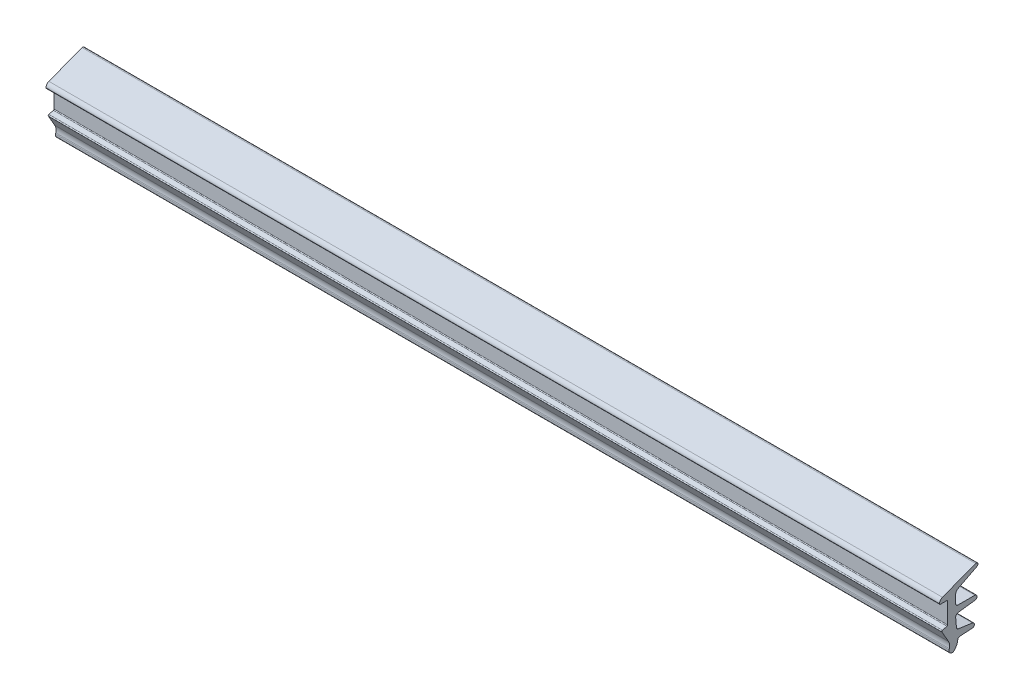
from build123d import *

# Parameters (mm, degrees)
PANEELITIIVISTEET_1_6020_PANEELITIIVISTE_DEPTH = 200


with BuildPart() as part:
    # Sketch1 → Paneelitiivisteet 1.6020 PANEELITIIVISTE (new body)
    with BuildSketch(Plane(origin=(0, 0, 0), x_dir=(0, 0, -1), z_dir=(1, 0, 0))):
        with BuildLine():
            Line((1.39116901, 4.409657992), (5.62675571, 6.567797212))
            ThreePointArc((5.62675571, 6.567797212), (5.810639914, 7.086754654), (5.302098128, 7.297741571))
            Line((5.302098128, 7.297741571), (-2.11249394, 4.458054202))
            ThreePointArc((-2.11249394, 4.458054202), (-2.578749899, 4.090921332), (-2.75484048, 3.524199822))
            ThreePointArc((-2.75484048, 3.524199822), (-2.696261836, 3.382778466), (-2.55484048, 3.324199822))
            Line((-2.55484048, 3.324199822), (-1.154840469, 3.324199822))
            ThreePointArc((-1.154840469, 3.324199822), (-1.013419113, 3.265621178), (-0.954840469, 3.124199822))
            Line((-0.954840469, 3.124199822), (-0.954840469, -1.475800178))
            ThreePointArc((-0.954840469, -1.475800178), (-0.996169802, -1.597552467), (-1.103076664, -1.668985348))
            Line((-1.103076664, -1.668985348), (-2.106604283, -1.937879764))
            ThreePointArc((-2.106604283, -1.937879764), (-2.23961638, -2.054528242), (-2.228045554, -2.231064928))
            Line((-2.228045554, -2.231064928), (-0.771162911, -4.754459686))
            ThreePointArc((-0.771162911, -4.754459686), (-0.520323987, -5.493407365), (-0.571362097, -6.272097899))
            Line((-0.571362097, -6.272097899), (-0.630988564, -6.494626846))
            ThreePointArc((-0.630988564, -6.494626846), (-0.285603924, -7.292724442), (0.570270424, -7.138680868))
            ThreePointArc((0.570270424, -7.138680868), (1.080637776, -6.373455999), (1.327562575, -5.487413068))
            ThreePointArc((1.327562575, -5.487413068), (1.480187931, -5.181371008), (1.793816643, -5.045013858))
            Line((1.793816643, -5.045013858), (4.575683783, -4.874867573))
            ThreePointArc((4.575683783, -4.874867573), (5.044774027, -4.395430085), (4.614746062, -3.880666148))
            Line((4.614746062, -3.880666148), (1.451016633, -3.436032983))
            ThreePointArc((1.451016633, -3.436032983), (1.157915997, -3.285076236), (1.022505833, -2.984476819))
            Line((1.022505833, -2.984476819), (0.847823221, -0.987845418))
            ThreePointArc((0.847823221, -0.987845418), (1.001157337, -0.486312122), (1.459850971, -0.232054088))
            Line((1.459850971, -0.232054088), (5.206094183, 0.227926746))
            ThreePointArc((5.206094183, 0.227926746), (5.644226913, 0.754724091), (5.145159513, 1.224199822))
            Line((5.145159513, 1.224199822), (1.345159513, 1.224199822))
            ThreePointArc((1.345159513, 1.224199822), (0.991606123, 1.370646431), (0.845159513, 1.724199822))
            Line((0.845159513, 1.724199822), (0.845159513, 3.518651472))
            ThreePointArc((0.845159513, 3.518651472), (0.992519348, 4.041150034), (1.39116901, 4.409657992))
        make_face()
    extrude(amount=PANEELITIIVISTEET_1_6020_PANEELITIIVISTE_DEPTH)


solid = part.part
